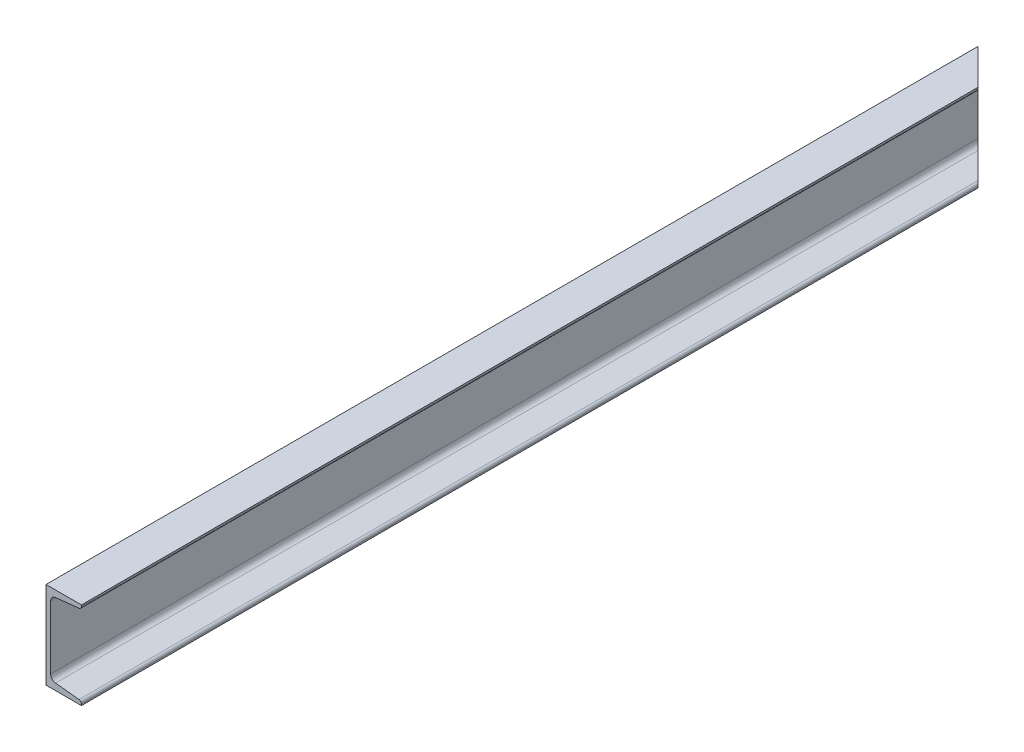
ISO-10303-21;
HEADER;
FILE_DESCRIPTION(('STEP AP214'),'2;1');
FILE_NAME('part.step','',(''),(''),'','','');
FILE_SCHEMA(('AUTOMOTIVE_DESIGN { 1 0 10303 214 1 1 1 1 }'));
ENDSEC;
DATA;
#1=APPLICATION_CONTEXT('core data for automotive mechanical design processes');
#2=APPLICATION_PROTOCOL_DEFINITION('international standard','automotive_design',2000,#1);
#3=PRODUCT_CONTEXT('',#1,'mechanical');
#4=PRODUCT('Part','Part','',(#3));
#5=PRODUCT_RELATED_PRODUCT_CATEGORY('part','',(#4));
#6=PRODUCT_DEFINITION_FORMATION('','',#4);
#7=PRODUCT_DEFINITION_CONTEXT('part definition',#1,'design');
#8=PRODUCT_DEFINITION('design','',#6,#7);
#9=PRODUCT_DEFINITION_SHAPE('','',#8);
#10=(LENGTH_UNIT() NAMED_UNIT(*) SI_UNIT(.MILLI.,.METRE.));
#11=(NAMED_UNIT(*) PLANE_ANGLE_UNIT() SI_UNIT($,.RADIAN.));
#12=(NAMED_UNIT(*) SI_UNIT($,.STERADIAN.) SOLID_ANGLE_UNIT());
#13=UNCERTAINTY_MEASURE_WITH_UNIT(LENGTH_MEASURE(1.E-05),#10,'distance_accuracy_value','');
#14=(GEOMETRIC_REPRESENTATION_CONTEXT(3) GLOBAL_UNCERTAINTY_ASSIGNED_CONTEXT((#13)) GLOBAL_UNIT_ASSIGNED_CONTEXT((#10,
#11,#12)) REPRESENTATION_CONTEXT('',''));
#15=CARTESIAN_POINT('',(0.,0.,0.));
#16=DIRECTION('',(0.,0.,1.));
#17=DIRECTION('',(1.,0.,0.));
#18=AXIS2_PLACEMENT_3D('',#15,#16,#17);
#19=CARTESIAN_POINT('',(65.0000000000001,80.,855.000000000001));
#20=DIRECTION('',(0.,-1.,0.));
#21=DIRECTION('',(1.,0.,0.));
#22=AXIS2_PLACEMENT_3D('',#19,#20,#21);
#23=PLANE('',#22);
#24=DIRECTION('',(0.,0.,-1.));
#25=VECTOR('',#24,1.);
#26=CARTESIAN_POINT('',(65.0000000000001,80.,855.000000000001));
#27=LINE('',#26,#25);
#28=CARTESIAN_POINT('',(65.0000000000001,80.,855.000000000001));
#29=VERTEX_POINT('',#28);
#30=CARTESIAN_POINT('',(65.0000000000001,80.,-790.));
#31=VERTEX_POINT('',#30);
#32=EDGE_CURVE('E145',#29,#31,#27,.T.);
#33=ORIENTED_EDGE('',*,*,#32,.T.);
#34=DIRECTION('',(0.707106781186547,0.,0.707106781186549));
#35=VECTOR('',#34,1.);
#36=CARTESIAN_POINT('',(65.0000000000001,80.,-790.));
#37=LINE('',#36,#35);
#38=CARTESIAN_POINT('',(0.,80.,-855.));
#39=VERTEX_POINT('',#38);
#40=EDGE_CURVE('E131',#39,#31,#37,.T.);
#41=ORIENTED_EDGE('',*,*,#40,.F.);
#42=DIRECTION('',(0.,0.,-1.));
#43=VECTOR('',#42,1.);
#44=CARTESIAN_POINT('',(0.,80.,855.000000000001));
#45=LINE('',#44,#43);
#46=CARTESIAN_POINT('',(0.,80.,855.000000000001));
#47=VERTEX_POINT('',#46);
#48=EDGE_CURVE('E11',#47,#39,#45,.T.);
#49=ORIENTED_EDGE('',*,*,#48,.F.);
#50=DIRECTION('',(-1.,0.,0.));
#51=VECTOR('',#50,1.);
#52=CARTESIAN_POINT('',(65.0000000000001,80.,855.000000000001));
#53=LINE('',#52,#51);
#54=EDGE_CURVE('E138',#29,#47,#53,.T.);
#55=ORIENTED_EDGE('',*,*,#54,.F.);
#56=EDGE_LOOP('',(#33,#41,#49,#55));
#57=FACE_BOUND('',#56,.T.);
#58=ADVANCED_FACE('F41',(#57),#23,.F.);
#59=CARTESIAN_POINT('',(0.,80.,855.000000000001));
#60=DIRECTION('',(1.,0.,0.));
#61=DIRECTION('',(0.,1.,0.));
#62=AXIS2_PLACEMENT_3D('',#59,#60,#61);
#63=PLANE('',#62);
#64=DIRECTION('',(0.,-1.,0.));
#65=VECTOR('',#64,1.);
#66=CARTESIAN_POINT('',(0.,80.,-855.));
#67=LINE('',#66,#65);
#68=CARTESIAN_POINT('',(0.,-80.,-855.));
#69=VERTEX_POINT('',#68);
#70=EDGE_CURVE('E128',#39,#69,#67,.T.);
#71=ORIENTED_EDGE('',*,*,#70,.T.);
#72=DIRECTION('',(0.,0.,-1.));
#73=VECTOR('',#72,1.);
#74=CARTESIAN_POINT('',(0.,-80.,855.000000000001));
#75=LINE('',#74,#73);
#76=CARTESIAN_POINT('',(0.,-80.,855.000000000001));
#77=VERTEX_POINT('',#76);
#78=EDGE_CURVE('E48',#77,#69,#75,.T.);
#79=ORIENTED_EDGE('',*,*,#78,.F.);
#80=DIRECTION('',(0.,-1.,0.));
#81=VECTOR('',#80,1.);
#82=CARTESIAN_POINT('',(0.,80.,855.000000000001));
#83=LINE('',#82,#81);
#84=EDGE_CURVE('E148',#47,#77,#83,.T.);
#85=ORIENTED_EDGE('',*,*,#84,.F.);
#86=ORIENTED_EDGE('',*,*,#48,.T.);
#87=EDGE_LOOP('',(#71,#79,#85,#86));
#88=FACE_BOUND('',#87,.T.);
#89=ADVANCED_FACE('F147',(#88),#63,.F.);
#90=CARTESIAN_POINT('',(0.,-80.,855.000000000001));
#91=DIRECTION('',(0.,1.,0.));
#92=DIRECTION('',(0.,0.,1.));
#93=AXIS2_PLACEMENT_3D('',#90,#91,#92);
#94=PLANE('',#93);
#95=ORIENTED_EDGE('',*,*,#78,.T.);
#96=DIRECTION('',(0.707106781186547,0.,0.707106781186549));
#97=VECTOR('',#96,1.);
#98=CARTESIAN_POINT('',(65.0000000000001,-80.,-790.));
#99=LINE('',#98,#97);
#100=CARTESIAN_POINT('',(65.0000000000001,-80.,-790.));
#101=VERTEX_POINT('',#100);
#102=EDGE_CURVE('E134',#69,#101,#99,.T.);
#103=ORIENTED_EDGE('',*,*,#102,.T.);
#104=DIRECTION('',(0.,0.,-1.));
#105=VECTOR('',#104,1.);
#106=CARTESIAN_POINT('',(64.9999999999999,-80.,855.000000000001));
#107=LINE('',#106,#105);
#108=CARTESIAN_POINT('',(64.9999999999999,-80.,855.000000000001));
#109=VERTEX_POINT('',#108);
#110=EDGE_CURVE('E198',#109,#101,#107,.T.);
#111=ORIENTED_EDGE('',*,*,#110,.F.);
#112=DIRECTION('',(1.,0.,0.));
#113=VECTOR('',#112,1.);
#114=CARTESIAN_POINT('',(0.,-80.,855.000000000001));
#115=LINE('',#114,#113);
#116=EDGE_CURVE('E150',#77,#109,#115,.T.);
#117=ORIENTED_EDGE('',*,*,#116,.F.);
#118=EDGE_LOOP('',(#95,#103,#111,#117));
#119=FACE_BOUND('',#118,.T.);
#120=ADVANCED_FACE('F201',(#119),#94,.F.);
#121=CARTESIAN_POINT('',(64.9999999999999,-80.,855.000000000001));
#122=DIRECTION('',(-1.,0.,0.));
#123=DIRECTION('',(0.,0.,1.));
#124=AXIS2_PLACEMENT_3D('',#121,#122,#123);
#125=PLANE('',#124);
#126=ORIENTED_EDGE('',*,*,#110,.T.);
#127=DIRECTION('',(0.,1.,0.));
#128=VECTOR('',#127,1.);
#129=CARTESIAN_POINT('',(65.0000000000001,-80.,-790.));
#130=LINE('',#129,#128);
#131=CARTESIAN_POINT('',(65.0000000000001,-77.4971407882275,-790.));
#132=VERTEX_POINT('',#131);
#133=EDGE_CURVE('E210',#101,#132,#130,.T.);
#134=ORIENTED_EDGE('',*,*,#133,.T.);
#135=DIRECTION('',(0.,0.,-1.));
#136=VECTOR('',#135,1.);
#137=CARTESIAN_POINT('',(64.9999999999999,-77.4971407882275,855.000000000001));
#138=LINE('',#137,#136);
#139=CARTESIAN_POINT('',(64.9999999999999,-77.4971407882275,855.000000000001));
#140=VERTEX_POINT('',#139);
#141=EDGE_CURVE('E195',#140,#132,#138,.T.);
#142=ORIENTED_EDGE('',*,*,#141,.F.);
#143=DIRECTION('',(0.,1.,0.));
#144=VECTOR('',#143,1.);
#145=CARTESIAN_POINT('',(64.9999999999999,-80.,855.000000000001));
#146=LINE('',#145,#144);
#147=EDGE_CURVE('E157',#109,#140,#146,.T.);
#148=ORIENTED_EDGE('',*,*,#147,.F.);
#149=EDGE_LOOP('',(#126,#134,#142,#148));
#150=FACE_BOUND('',#149,.T.);
#151=ADVANCED_FACE('F209',(#150),#125,.F.);
#152=CARTESIAN_POINT('',(60.0000000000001,-77.4971407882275,855.000000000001));
#153=DIRECTION('',(0.,0.,-1.));
#154=DIRECTION('',(-1.,0.,0.));
#155=AXIS2_PLACEMENT_3D('',#152,#153,#154);
#156=CYLINDRICAL_SURFACE('',#155,4.99999999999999);
#157=ORIENTED_EDGE('',*,*,#141,.T.);
#158=CARTESIAN_POINT('',(60.0000000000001,-77.4971407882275,-795.));
#159=DIRECTION('',(-0.707106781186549,0.,0.707106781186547));
#160=DIRECTION('',(-0.707106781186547,0.,-0.707106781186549));
#161=AXIS2_PLACEMENT_3D('',#158,#159,#160);
#162=ELLIPSE('',#161,7.07106781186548,4.99999999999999);
#163=CARTESIAN_POINT('',(60.528004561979,-72.5250978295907,-794.471995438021));
#164=VERTEX_POINT('',#163);
#165=EDGE_CURVE('E139',#132,#164,#162,.T.);
#166=ORIENTED_EDGE('',*,*,#165,.T.);
#167=DIRECTION('',(0.,0.,-1.));
#168=VECTOR('',#167,1.);
#169=CARTESIAN_POINT('',(60.5280045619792,-72.5250978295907,855.000000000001));
#170=LINE('',#169,#168);
#171=CARTESIAN_POINT('',(60.5280045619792,-72.5250978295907,855.000000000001));
#172=VERTEX_POINT('',#171);
#173=EDGE_CURVE('E192',#172,#164,#170,.T.);
#174=ORIENTED_EDGE('',*,*,#173,.F.);
#175=CARTESIAN_POINT('',(60.0000000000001,-77.4971407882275,855.000000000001));
#176=DIRECTION('',(0.,0.,1.));
#177=DIRECTION('',(1.,0.,0.));
#178=AXIS2_PLACEMENT_3D('',#175,#176,#177);
#179=CIRCLE('',#178,4.99999999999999);
#180=EDGE_CURVE('E159',#140,#172,#179,.T.);
#181=ORIENTED_EDGE('',*,*,#180,.F.);
#182=EDGE_LOOP('',(#157,#166,#174,#181));
#183=FACE_BOUND('',#182,.T.);
#184=ADVANCED_FACE('F213',(#183),#156,.T.);
#185=CARTESIAN_POINT('',(60.5280045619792,-72.5250978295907,855.000000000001));
#186=DIRECTION('',(-0.105600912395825,-0.994408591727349,0.));
#187=DIRECTION('',(0.99440859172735,-0.105600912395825,0.));
#188=AXIS2_PLACEMENT_3D('',#185,#186,#187);
#189=PLANE('',#188);
#190=ORIENTED_EDGE('',*,*,#173,.T.);
#191=DIRECTION('',(-0.705121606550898,0.0748801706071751,-0.7051216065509));
#192=VECTOR('',#191,1.);
#193=CARTESIAN_POINT('',(880.639674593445,-159.616602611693,25.6396745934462));
#194=LINE('',#193,#192);
#195=CARTESIAN_POINT('',(17.4439908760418,-67.9498043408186,-837.556009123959));
#196=VERTEX_POINT('',#195);
#197=EDGE_CURVE('E258',#164,#196,#194,.T.);
#198=ORIENTED_EDGE('',*,*,#197,.T.);
#199=DIRECTION('',(0.,0.,-1.));
#200=VECTOR('',#199,1.);
#201=CARTESIAN_POINT('',(17.4439908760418,-67.9498043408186,855.000000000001));
#202=LINE('',#201,#200);
#203=CARTESIAN_POINT('',(17.4439908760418,-67.9498043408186,855.000000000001));
#204=VERTEX_POINT('',#203);
#205=EDGE_CURVE('E189',#204,#196,#202,.T.);
#206=ORIENTED_EDGE('',*,*,#205,.F.);
#207=DIRECTION('',(-0.994408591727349,0.105600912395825,0.));
#208=VECTOR('',#207,1.);
#209=CARTESIAN_POINT('',(60.5280045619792,-72.5250978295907,855.000000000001));
#210=LINE('',#209,#208);
#211=EDGE_CURVE('E161',#172,#204,#210,.T.);
#212=ORIENTED_EDGE('',*,*,#211,.F.);
#213=EDGE_LOOP('',(#190,#198,#206,#212));
#214=FACE_BOUND('',#213,.T.);
#215=ADVANCED_FACE('F218',(#214),#189,.F.);
#216=CARTESIAN_POINT('',(18.5,-58.0057184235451,855.000000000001));
#217=DIRECTION('',(0.,0.,-1.));
#218=DIRECTION('',(-1.,0.,0.));
#219=AXIS2_PLACEMENT_3D('',#216,#217,#218);
#220=CYLINDRICAL_SURFACE('',#219,9.99999999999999);
#221=ORIENTED_EDGE('',*,*,#205,.T.);
#222=CARTESIAN_POINT('',(18.5,-58.0057184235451,-836.500000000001));
#223=DIRECTION('',(-0.707106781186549,0.,0.707106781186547));
#224=DIRECTION('',(-0.707106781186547,0.,-0.707106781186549));
#225=AXIS2_PLACEMENT_3D('',#222,#223,#224);
#226=ELLIPSE('',#225,14.142135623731,9.99999999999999);
#227=CARTESIAN_POINT('',(8.49999999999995,-58.0057184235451,-846.5));
#228=VERTEX_POINT('',#227);
#229=EDGE_CURVE('E226',#196,#228,#226,.F.);
#230=ORIENTED_EDGE('',*,*,#229,.T.);
#231=DIRECTION('',(0.,0.,-1.));
#232=VECTOR('',#231,1.);
#233=CARTESIAN_POINT('',(8.49999999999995,-58.0057184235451,855.000000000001));
#234=LINE('',#233,#232);
#235=CARTESIAN_POINT('',(8.49999999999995,-58.0057184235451,855.000000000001));
#236=VERTEX_POINT('',#235);
#237=EDGE_CURVE('E186',#236,#228,#234,.T.);
#238=ORIENTED_EDGE('',*,*,#237,.F.);
#239=CARTESIAN_POINT('',(18.5,-58.0057184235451,855.000000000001));
#240=DIRECTION('',(0.,0.,-1.));
#241=DIRECTION('',(-1.,0.,0.));
#242=AXIS2_PLACEMENT_3D('',#239,#240,#241);
#243=CIRCLE('',#242,9.99999999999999);
#244=EDGE_CURVE('E163',#204,#236,#243,.T.);
#245=ORIENTED_EDGE('',*,*,#244,.F.);
#246=EDGE_LOOP('',(#221,#230,#238,#245));
#247=FACE_BOUND('',#246,.T.);
#248=ADVANCED_FACE('F225',(#247),#220,.F.);
#249=CARTESIAN_POINT('',(8.49999999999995,-58.0057184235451,855.000000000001));
#250=DIRECTION('',(-1.,0.,0.));
#251=DIRECTION('',(0.,-1.,0.));
#252=AXIS2_PLACEMENT_3D('',#249,#250,#251);
#253=PLANE('',#252);
#254=ORIENTED_EDGE('',*,*,#237,.T.);
#255=DIRECTION('',(0.,1.,0.));
#256=VECTOR('',#255,1.);
#257=CARTESIAN_POINT('',(8.49999999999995,-58.0057184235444,-846.5));
#258=LINE('',#257,#256);
#259=CARTESIAN_POINT('',(8.50000000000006,58.0057184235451,-846.5));
#260=VERTEX_POINT('',#259);
#261=EDGE_CURVE('E231',#228,#260,#258,.T.);
#262=ORIENTED_EDGE('',*,*,#261,.T.);
#263=DIRECTION('',(0.,0.,-1.));
#264=VECTOR('',#263,1.);
#265=CARTESIAN_POINT('',(8.50000000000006,58.0057184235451,855.000000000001));
#266=LINE('',#265,#264);
#267=CARTESIAN_POINT('',(8.50000000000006,58.0057184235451,855.000000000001));
#268=VERTEX_POINT('',#267);
#269=EDGE_CURVE('E183',#268,#260,#266,.T.);
#270=ORIENTED_EDGE('',*,*,#269,.F.);
#271=DIRECTION('',(0.,1.,0.));
#272=VECTOR('',#271,1.);
#273=CARTESIAN_POINT('',(8.49999999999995,-58.0057184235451,855.000000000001));
#274=LINE('',#273,#272);
#275=EDGE_CURVE('E165',#236,#268,#274,.T.);
#276=ORIENTED_EDGE('',*,*,#275,.F.);
#277=EDGE_LOOP('',(#254,#262,#270,#276));
#278=FACE_BOUND('',#277,.T.);
#279=ADVANCED_FACE('F229',(#278),#253,.F.);
#280=CARTESIAN_POINT('',(18.5000000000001,58.0057184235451,855.000000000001));
#281=DIRECTION('',(0.,0.,-1.));
#282=DIRECTION('',(-1.,0.,0.));
#283=AXIS2_PLACEMENT_3D('',#280,#281,#282);
#284=CYLINDRICAL_SURFACE('',#283,10.);
#285=ORIENTED_EDGE('',*,*,#269,.T.);
#286=CARTESIAN_POINT('',(18.5000000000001,58.0057184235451,-836.5));
#287=DIRECTION('',(-0.707106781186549,0.,0.707106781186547));
#288=DIRECTION('',(-0.707106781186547,0.,-0.707106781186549));
#289=AXIS2_PLACEMENT_3D('',#286,#287,#288);
#290=ELLIPSE('',#289,14.142135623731,10.);
#291=CARTESIAN_POINT('',(17.4439908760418,67.9498043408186,-837.556009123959));
#292=VERTEX_POINT('',#291);
#293=EDGE_CURVE('E254',#260,#292,#290,.F.);
#294=ORIENTED_EDGE('',*,*,#293,.T.);
#295=DIRECTION('',(0.,0.,-1.));
#296=VECTOR('',#295,1.);
#297=CARTESIAN_POINT('',(17.4439908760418,67.9498043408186,855.000000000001));
#298=LINE('',#297,#296);
#299=CARTESIAN_POINT('',(17.4439908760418,67.9498043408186,855.000000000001));
#300=VERTEX_POINT('',#299);
#301=EDGE_CURVE('E180',#300,#292,#298,.T.);
#302=ORIENTED_EDGE('',*,*,#301,.F.);
#303=CARTESIAN_POINT('',(18.5000000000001,58.0057184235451,855.000000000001));
#304=DIRECTION('',(0.,0.,-1.));
#305=DIRECTION('',(-1.,0.,0.));
#306=AXIS2_PLACEMENT_3D('',#303,#304,#305);
#307=CIRCLE('',#306,10.);
#308=EDGE_CURVE('E167',#268,#300,#307,.T.);
#309=ORIENTED_EDGE('',*,*,#308,.F.);
#310=EDGE_LOOP('',(#285,#294,#302,#309));
#311=FACE_BOUND('',#310,.T.);
#312=ADVANCED_FACE('F235',(#311),#284,.F.);
#313=CARTESIAN_POINT('',(17.4439908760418,67.9498043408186,855.000000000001));
#314=DIRECTION('',(-0.105600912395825,0.994408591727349,0.));
#315=DIRECTION('',(-0.99440859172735,-0.105600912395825,0.));
#316=AXIS2_PLACEMENT_3D('',#313,#314,#315);
#317=PLANE('',#316);
#318=ORIENTED_EDGE('',*,*,#301,.T.);
#319=DIRECTION('',(0.705121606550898,0.0748801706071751,0.7051216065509));
#320=VECTOR('',#319,1.);
#321=CARTESIAN_POINT('',(858.976880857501,157.31612894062,3.97688085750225));
#322=LINE('',#321,#320);
#323=CARTESIAN_POINT('',(60.5280045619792,72.5250978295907,-794.471995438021));
#324=VERTEX_POINT('',#323);
#325=EDGE_CURVE('E241',#292,#324,#322,.T.);
#326=ORIENTED_EDGE('',*,*,#325,.T.);
#327=DIRECTION('',(0.,0.,-1.));
#328=VECTOR('',#327,1.);
#329=CARTESIAN_POINT('',(60.5280045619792,72.5250978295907,855.000000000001));
#330=LINE('',#329,#328);
#331=CARTESIAN_POINT('',(60.5280045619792,72.5250978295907,855.000000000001));
#332=VERTEX_POINT('',#331);
#333=EDGE_CURVE('E177',#332,#324,#330,.T.);
#334=ORIENTED_EDGE('',*,*,#333,.F.);
#335=DIRECTION('',(0.994408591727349,0.105600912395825,0.));
#336=VECTOR('',#335,1.);
#337=CARTESIAN_POINT('',(17.4439908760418,67.9498043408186,855.000000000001));
#338=LINE('',#337,#336);
#339=EDGE_CURVE('E169',#300,#332,#338,.T.);
#340=ORIENTED_EDGE('',*,*,#339,.F.);
#341=EDGE_LOOP('',(#318,#326,#334,#340));
#342=FACE_BOUND('',#341,.T.);
#343=ADVANCED_FACE('F240',(#342),#317,.F.);
#344=CARTESIAN_POINT('',(60.0000000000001,77.4971407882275,855.000000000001));
#345=DIRECTION('',(0.,0.,-1.));
#346=DIRECTION('',(-1.,0.,0.));
#347=AXIS2_PLACEMENT_3D('',#344,#345,#346);
#348=CYLINDRICAL_SURFACE('',#347,5.00000000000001);
#349=ORIENTED_EDGE('',*,*,#333,.T.);
#350=CARTESIAN_POINT('',(60.0000000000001,77.4971407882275,-795.));
#351=DIRECTION('',(-0.707106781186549,0.,0.707106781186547));
#352=DIRECTION('',(-0.707106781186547,0.,-0.707106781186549));
#353=AXIS2_PLACEMENT_3D('',#350,#351,#352);
#354=ELLIPSE('',#353,7.07106781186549,5.00000000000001);
#355=CARTESIAN_POINT('',(65.0000000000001,77.4971407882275,-790.));
#356=VERTEX_POINT('',#355);
#357=EDGE_CURVE('E245',#324,#356,#354,.T.);
#358=ORIENTED_EDGE('',*,*,#357,.T.);
#359=DIRECTION('',(0.,0.,-1.));
#360=VECTOR('',#359,1.);
#361=CARTESIAN_POINT('',(65.0000000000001,77.4971407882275,855.000000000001));
#362=LINE('',#361,#360);
#363=CARTESIAN_POINT('',(65.0000000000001,77.4971407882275,855.000000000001));
#364=VERTEX_POINT('',#363);
#365=EDGE_CURVE('E174',#364,#356,#362,.T.);
#366=ORIENTED_EDGE('',*,*,#365,.F.);
#367=CARTESIAN_POINT('',(60.0000000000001,77.4971407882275,855.000000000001));
#368=DIRECTION('',(0.,0.,1.));
#369=DIRECTION('',(1.,0.,0.));
#370=AXIS2_PLACEMENT_3D('',#367,#368,#369);
#371=CIRCLE('',#370,5.00000000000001);
#372=EDGE_CURVE('E60',#332,#364,#371,.T.);
#373=ORIENTED_EDGE('',*,*,#372,.F.);
#374=EDGE_LOOP('',(#349,#358,#366,#373));
#375=FACE_BOUND('',#374,.T.);
#376=ADVANCED_FACE('F244',(#375),#348,.T.);
#377=CARTESIAN_POINT('',(65.0000000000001,77.4971407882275,855.000000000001));
#378=DIRECTION('',(-1.,0.,0.));
#379=DIRECTION('',(0.,-1.,0.));
#380=AXIS2_PLACEMENT_3D('',#377,#378,#379);
#381=PLANE('',#380);
#382=ORIENTED_EDGE('',*,*,#365,.T.);
#383=EDGE_CURVE('E248',#356,#31,#130,.T.);
#384=ORIENTED_EDGE('',*,*,#383,.T.);
#385=ORIENTED_EDGE('',*,*,#32,.F.);
#386=DIRECTION('',(0.,1.,0.));
#387=VECTOR('',#386,1.);
#388=CARTESIAN_POINT('',(65.0000000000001,77.4971407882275,855.000000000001));
#389=LINE('',#388,#387);
#390=EDGE_CURVE('E55',#364,#29,#389,.T.);
#391=ORIENTED_EDGE('',*,*,#390,.F.);
#392=EDGE_LOOP('',(#382,#384,#385,#391));
#393=FACE_BOUND('',#392,.T.);
#394=ADVANCED_FACE('F247',(#393),#381,.F.);
#395=CARTESIAN_POINT('',(60.0000000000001,-77.4971407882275,855.000000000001));
#396=DIRECTION('',(0.,0.,1.));
#397=DIRECTION('',(1.,0.,0.));
#398=AXIS2_PLACEMENT_3D('',#395,#396,#397);
#399=PLANE('',#398);
#400=ORIENTED_EDGE('',*,*,#54,.T.);
#401=ORIENTED_EDGE('',*,*,#84,.T.);
#402=ORIENTED_EDGE('',*,*,#116,.T.);
#403=ORIENTED_EDGE('',*,*,#147,.T.);
#404=ORIENTED_EDGE('',*,*,#180,.T.);
#405=ORIENTED_EDGE('',*,*,#211,.T.);
#406=ORIENTED_EDGE('',*,*,#244,.T.);
#407=ORIENTED_EDGE('',*,*,#275,.T.);
#408=ORIENTED_EDGE('',*,*,#308,.T.);
#409=ORIENTED_EDGE('',*,*,#339,.T.);
#410=ORIENTED_EDGE('',*,*,#372,.T.);
#411=ORIENTED_EDGE('',*,*,#390,.T.);
#412=EDGE_LOOP('',(#400,#401,#402,#403,#404,#405,#406,#407,#408,#409,#410,#411));
#413=FACE_BOUND('',#412,.T.);
#414=ADVANCED_FACE('F152',(#413),#399,.T.);
#415=CARTESIAN_POINT('',(65.0000000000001,-80.,-790.));
#416=DIRECTION('',(-0.707106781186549,0.,0.707106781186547));
#417=DIRECTION('',(0.707106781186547,0.,0.707106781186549));
#418=AXIS2_PLACEMENT_3D('',#415,#416,#417);
#419=PLANE('',#418);
#420=ORIENTED_EDGE('',*,*,#133,.F.);
#421=ORIENTED_EDGE('',*,*,#102,.F.);
#422=ORIENTED_EDGE('',*,*,#70,.F.);
#423=ORIENTED_EDGE('',*,*,#40,.T.);
#424=ORIENTED_EDGE('',*,*,#383,.F.);
#425=ORIENTED_EDGE('',*,*,#357,.F.);
#426=ORIENTED_EDGE('',*,*,#325,.F.);
#427=ORIENTED_EDGE('',*,*,#293,.F.);
#428=ORIENTED_EDGE('',*,*,#261,.F.);
#429=ORIENTED_EDGE('',*,*,#229,.F.);
#430=ORIENTED_EDGE('',*,*,#197,.F.);
#431=ORIENTED_EDGE('',*,*,#165,.F.);
#432=EDGE_LOOP('',(#420,#421,#422,#423,#424,#425,#426,#427,#428,#429,#430,#431));
#433=FACE_BOUND('',#432,.T.);
#434=ADVANCED_FACE('F130',(#433),#419,.F.);
#435=CLOSED_SHELL('',(#58,#89,#120,#151,#184,#215,#248,#279,#312,#343,#376,#394,#414,#434));
#436=MANIFOLD_SOLID_BREP('B2',#435);
#437=ADVANCED_BREP_SHAPE_REPRESENTATION('',(#18,#436),#14);
#438=SHAPE_DEFINITION_REPRESENTATION(#9,#437);
ENDSEC;
END-ISO-10303-21;
